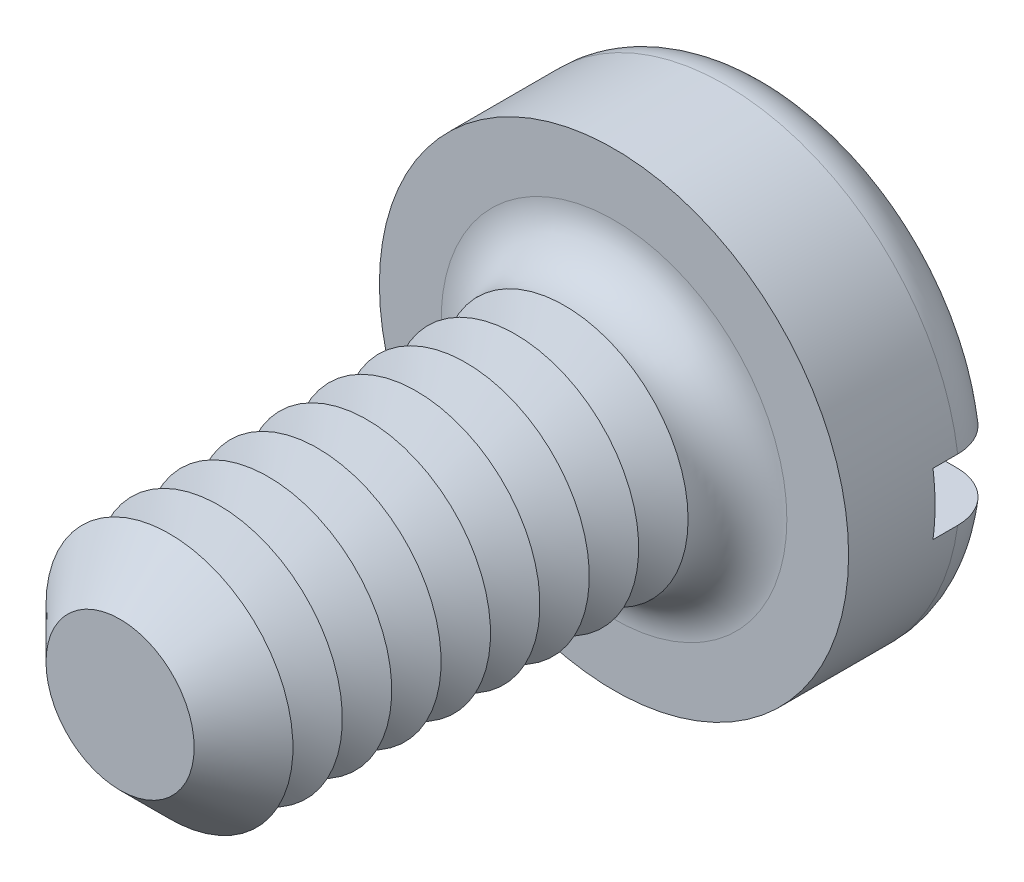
ISO-10303-21;
HEADER;
FILE_DESCRIPTION(('STEP AP214'),'2;1');
FILE_NAME('part.step','',(''),(''),'','','');
FILE_SCHEMA(('AUTOMOTIVE_DESIGN { 1 0 10303 214 1 1 1 1 }'));
ENDSEC;
DATA;
#1=APPLICATION_CONTEXT('core data for automotive mechanical design processes');
#2=APPLICATION_PROTOCOL_DEFINITION('international standard','automotive_design',2000,#1);
#3=PRODUCT_CONTEXT('',#1,'mechanical');
#4=PRODUCT('Part','Part','',(#3));
#5=PRODUCT_RELATED_PRODUCT_CATEGORY('part','',(#4));
#6=PRODUCT_DEFINITION_FORMATION('','',#4);
#7=PRODUCT_DEFINITION_CONTEXT('part definition',#1,'design');
#8=PRODUCT_DEFINITION('design','',#6,#7);
#9=PRODUCT_DEFINITION_SHAPE('','',#8);
#10=(LENGTH_UNIT() NAMED_UNIT(*) SI_UNIT(.MILLI.,.METRE.));
#11=(NAMED_UNIT(*) PLANE_ANGLE_UNIT() SI_UNIT($,.RADIAN.));
#12=(NAMED_UNIT(*) SI_UNIT($,.STERADIAN.) SOLID_ANGLE_UNIT());
#13=UNCERTAINTY_MEASURE_WITH_UNIT(LENGTH_MEASURE(1.E-05),#10,'distance_accuracy_value','');
#14=(GEOMETRIC_REPRESENTATION_CONTEXT(3) GLOBAL_UNCERTAINTY_ASSIGNED_CONTEXT((#13)) GLOBAL_UNIT_ASSIGNED_CONTEXT((#10,
#11,#12)) REPRESENTATION_CONTEXT('',''));
#15=CARTESIAN_POINT('',(0.,0.,0.));
#16=DIRECTION('',(0.,0.,1.));
#17=DIRECTION('',(1.,0.,0.));
#18=AXIS2_PLACEMENT_3D('',#15,#16,#17);
#19=CARTESIAN_POINT('',(0.,0.,-1.3));
#20=DIRECTION('',(0.,0.,1.));
#21=DIRECTION('',(1.,0.,0.));
#22=AXIS2_PLACEMENT_3D('',#19,#20,#21);
#23=PLANE('',#22);
#24=CARTESIAN_POINT('',(0.,0.,-1.3));
#25=DIRECTION('',(0.,0.,1.));
#26=DIRECTION('',(1.,0.,0.));
#27=AXIS2_PLACEMENT_3D('',#24,#25,#26);
#28=CIRCLE('',#27,1.5);
#29=CARTESIAN_POINT('',(-1.4790199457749,0.25,-1.3));
#30=VERTEX_POINT('',#29);
#31=CARTESIAN_POINT('',(1.4790199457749,0.25,-1.3));
#32=VERTEX_POINT('',#31);
#33=EDGE_CURVE('E116',#30,#32,#28,.F.);
#34=ORIENTED_EDGE('',*,*,#33,.T.);
#35=DIRECTION('',(1.,0.,0.));
#36=VECTOR('',#35,1.);
#37=CARTESIAN_POINT('',(-1.9,0.25,-1.3));
#38=LINE('',#37,#36);
#39=EDGE_CURVE('E111',#30,#32,#38,.T.);
#40=ORIENTED_EDGE('',*,*,#39,.F.);
#41=EDGE_LOOP('',(#34,#40));
#42=FACE_BOUND('',#41,.T.);
#43=ADVANCED_FACE('F39',(#42),#23,.F.);
#44=CARTESIAN_POINT('',(0.,0.,-0.9));
#45=DIRECTION('',(0.,0.,1.));
#46=DIRECTION('',(1.,0.,0.));
#47=AXIS2_PLACEMENT_3D('',#44,#45,#46);
#48=TOROIDAL_SURFACE('',#47,1.5,0.4);
#49=CARTESIAN_POINT('',(-1.8150392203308,0.25,-1.12284384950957));
#50=CARTESIAN_POINT('',(-1.80236980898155,0.25,-1.14155059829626));
#51=CARTESIAN_POINT('',(-1.78809920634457,0.25,-1.15919399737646));
#52=CARTESIAN_POINT('',(-1.75677844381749,0.25,-1.19184073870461));
#53=CARTESIAN_POINT('',(-1.73972468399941,0.25,-1.20684060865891));
#54=CARTESIAN_POINT('',(-1.70336024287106,0.25,-1.23375848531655));
#55=CARTESIAN_POINT('',(-1.68405164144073,0.25,-1.24567930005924));
#56=CARTESIAN_POINT('',(-1.64372549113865,0.25,-1.26613528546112));
#57=CARTESIAN_POINT('',(-1.6227083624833,0.25,-1.27467128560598));
#58=CARTESIAN_POINT('',(-1.57937988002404,0.25,-1.2881995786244));
#59=CARTESIAN_POINT('',(-1.55705957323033,0.25,-1.29316318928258));
#60=CARTESIAN_POINT('',(-1.51190394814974,0.25,-1.29931753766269));
#61=CARTESIAN_POINT('',(-1.48906857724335,0.25,-1.3005078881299));
#62=CARTESIAN_POINT('',(-1.4432641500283,0.25,-1.29909058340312));
#63=CARTESIAN_POINT('',(-1.42029638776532,0.25,-1.29644099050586));
#64=CARTESIAN_POINT('',(-1.37512297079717,0.25,-1.28735146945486));
#65=CARTESIAN_POINT('',(-1.3529173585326,0.25,-1.28091133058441));
#66=CARTESIAN_POINT('',(-1.30974098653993,0.25,-1.26436295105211));
#67=CARTESIAN_POINT('',(-1.28877978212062,0.25,-1.25422975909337));
#68=CARTESIAN_POINT('',(-1.24886205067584,0.25,-1.23057736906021));
#69=CARTESIAN_POINT('',(-1.22990554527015,0.25,-1.21705813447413));
#70=CARTESIAN_POINT('',(-1.19461911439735,0.25,-1.18704970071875));
#71=CARTESIAN_POINT('',(-1.17828051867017,0.25,-1.17057070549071));
#72=CARTESIAN_POINT('',(-1.14865897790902,0.25,-1.13506201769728));
#73=CARTESIAN_POINT('',(-1.13537576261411,0.25,-1.11603255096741));
#74=CARTESIAN_POINT('',(-1.11249827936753,0.25,-1.07630328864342));
#75=CARTESIAN_POINT('',(-1.10284494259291,0.25,-1.05563752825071));
#76=CARTESIAN_POINT('',(-1.08724024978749,0.25,-1.01295282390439));
#77=CARTESIAN_POINT('',(-1.08128829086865,0.25,-0.990934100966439));
#78=CARTESIAN_POINT('',(-1.07339124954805,0.25,-0.946722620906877));
#79=CARTESIAN_POINT('',(-1.07135558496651,0.25,-0.924546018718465));
#80=CARTESIAN_POINT('',(-1.07108722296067,0.25,-0.880170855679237));
#81=CARTESIAN_POINT('',(-1.07285419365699,0.25,-0.857972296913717));
#82=CARTESIAN_POINT('',(-1.0800838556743,0.25,-0.814463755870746));
#83=CARTESIAN_POINT('',(-1.08550159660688,0.25,-0.793146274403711));
#84=CARTESIAN_POINT('',(-1.09980522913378,0.25,-0.751709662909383));
#85=CARTESIAN_POINT('',(-1.10869126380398,0.25,-0.731590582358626));
#86=CARTESIAN_POINT('',(-1.12975121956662,0.25,-0.692901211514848));
#87=CARTESIAN_POINT('',(-1.14195627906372,0.25,-0.674347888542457));
#88=CARTESIAN_POINT('',(-1.1692428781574,0.25,-0.639494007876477));
#89=CARTESIAN_POINT('',(-1.18432473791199,0.25,-0.623193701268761));
#90=CARTESIAN_POINT('',(-1.21730350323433,0.25,-0.592916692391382));
#91=CARTESIAN_POINT('',(-1.23525650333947,0.25,-0.579001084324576));
#92=CARTESIAN_POINT('',(-1.27320799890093,0.25,-0.554314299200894));
#93=CARTESIAN_POINT('',(-1.2932067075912,0.25,-0.543543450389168));
#94=CARTESIAN_POINT('',(-1.33509120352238,0.25,-0.525253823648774));
#95=CARTESIAN_POINT('',(-1.35700545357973,0.25,-0.517800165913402));
#96=CARTESIAN_POINT('',(-1.401770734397,0.25,-0.506652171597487));
#97=CARTESIAN_POINT('',(-1.42462180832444,0.25,-0.502958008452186));
#98=CARTESIAN_POINT('',(-1.4707602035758,0.25,-0.499429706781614));
#99=CARTESIAN_POINT('',(-1.49404932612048,0.25,-0.499619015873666));
#100=CARTESIAN_POINT('',(-1.54026206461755,0.25,-0.50392615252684));
#101=CARTESIAN_POINT('',(-1.56318568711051,0.25,-0.508043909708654));
#102=CARTESIAN_POINT('',(-1.60788420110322,0.25,-0.520077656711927));
#103=CARTESIAN_POINT('',(-1.6296645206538,0.25,-0.527973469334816));
#104=CARTESIAN_POINT('',(-1.67156889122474,0.25,-0.547348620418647));
#105=CARTESIAN_POINT('',(-1.69169302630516,0.25,-0.558827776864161));
#106=CARTESIAN_POINT('',(-1.72948251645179,0.25,-0.584913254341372));
#107=CARTESIAN_POINT('',(-1.74717189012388,0.25,-0.599484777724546));
#108=CARTESIAN_POINT('',(-1.77981909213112,0.25,-0.63142070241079));
#109=CARTESIAN_POINT('',(-1.79477707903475,0.25,-0.648784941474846));
#110=CARTESIAN_POINT('',(-1.82136524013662,0.25,-0.685607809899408));
#111=CARTESIAN_POINT('',(-1.83303003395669,0.25,-0.705041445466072));
#112=CARTESIAN_POINT('',(-1.85289960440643,0.25,-0.745602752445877));
#113=CARTESIAN_POINT('',(-1.86110468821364,0.25,-0.76673027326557));
#114=CARTESIAN_POINT('',(-1.87375648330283,0.25,-0.809891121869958));
#115=CARTESIAN_POINT('',(-1.87823381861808,0.25,-0.831915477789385));
#116=CARTESIAN_POINT('',(-1.88341152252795,0.25,-0.87640983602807));
#117=CARTESIAN_POINT('',(-1.88411103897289,0.25,-0.898879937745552));
#118=CARTESIAN_POINT('',(-1.88171559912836,0.25,-0.943534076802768));
#119=CARTESIAN_POINT('',(-1.87863413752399,0.25,-0.965718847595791));
#120=CARTESIAN_POINT('',(-1.86879153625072,0.25,-1.00923650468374));
#121=CARTESIAN_POINT('',(-1.86203494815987,0.25,-1.03057040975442));
#122=CARTESIAN_POINT('',(-1.84837477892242,0.25,-1.06373797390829));
#123=CARTESIAN_POINT('',(-1.84255723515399,0.25,-1.07603047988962));
#124=CARTESIAN_POINT('',(-1.82969924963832,0.25,-1.09995814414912));
#125=CARTESIAN_POINT('',(-1.82265881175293,0.25,-1.11159330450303));
#126=CARTESIAN_POINT('',(-1.8150392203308,0.25,-1.12284384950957));
#127=B_SPLINE_CURVE_WITH_KNOTS('',3,(#49,#50,#51,#52,#53,#54,#55,#56,#57,#58,#59,#60,#61,#62,
#63,#64,#65,#66,#67,#68,#69,#70,#71,#72,#73,#74,#75,#76,#77,#78,#79,#80,#81,#82,#83,#84,#85,#86,
#87,#88,#89,#90,#91,#92,#93,#94,#95,#96,#97,#98,#99,#100,#101,#102,#103,#104,#105,#106,#107,
#108,#109,#110,#111,#112,#113,#114,#115,#116,#117,#118,#119,#120,#121,#122,#123,#124,#125,#126),
.UNSPECIFIED.,.T.,.F.,(4,2,2,2,2,2,2,2,2,2,2,2,2,2,2,2,2,2,2,2,2,2,2,2,2,2,2,2,2,2,2,2,2,2,2,2,
2,2,4),(0.,0.0677296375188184,0.135547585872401,0.203303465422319,0.27104273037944,
0.339319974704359,0.407604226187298,0.47663988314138,0.545679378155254,0.615194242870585,
0.684709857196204,0.753990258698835,0.82326452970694,0.891356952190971,0.959438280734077,
1.02592503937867,1.0924059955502,1.15808300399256,1.2237627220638,1.29008126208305,
1.35640718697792,1.4242376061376,1.49207510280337,1.5611911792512,1.63031044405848,
1.69984715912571,1.76938262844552,1.8385508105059,1.90771547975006,1.97613962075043,
2.04455978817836,2.11223135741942,2.17989691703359,2.24700094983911,2.31412011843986,
2.38100042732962,2.44779809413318,2.48853193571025,2.52926564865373),.UNSPECIFIED.);
#128=CARTESIAN_POINT('',(-1.88348082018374,0.25,-0.9));
#129=VERTEX_POINT('',#128);
#130=EDGE_CURVE('E241',#129,#30,#127,.T.);
#131=ORIENTED_EDGE('',*,*,#130,.F.);
#132=CARTESIAN_POINT('',(0.,0.,-0.9));
#133=DIRECTION('',(0.,0.,1.));
#134=DIRECTION('',(1.,0.,0.));
#135=AXIS2_PLACEMENT_3D('',#132,#133,#134);
#136=CIRCLE('',#135,1.9);
#137=CARTESIAN_POINT('',(1.88348082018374,0.25,-0.9));
#138=VERTEX_POINT('',#137);
#139=EDGE_CURVE('E123',#138,#129,#136,.T.);
#140=ORIENTED_EDGE('',*,*,#139,.F.);
#141=CARTESIAN_POINT('',(1.11362660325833,0.25,-1.07710243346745));
#142=CARTESIAN_POINT('',(1.12388366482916,0.25,-1.09736755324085));
#143=CARTESIAN_POINT('',(1.13589127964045,0.25,-1.11676768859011));
#144=CARTESIAN_POINT('',(1.16301945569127,0.25,-1.15328107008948));
#145=CARTESIAN_POINT('',(1.17814463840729,0.25,-1.17039085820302));
#146=CARTESIAN_POINT('',(1.21101661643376,0.25,-1.20182395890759));
#147=CARTESIAN_POINT('',(1.22875976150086,0.25,-1.21615108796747));
#148=CARTESIAN_POINT('',(1.26636392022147,0.25,-1.24166932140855));
#149=CARTESIAN_POINT('',(1.28622436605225,0.25,-1.25286126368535));
#150=CARTESIAN_POINT('',(1.32781377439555,0.25,-1.27196191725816));
#151=CARTESIAN_POINT('',(1.34956550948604,0.25,-1.27982107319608));
#152=CARTESIAN_POINT('',(1.39407620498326,0.25,-1.29180513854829));
#153=CARTESIAN_POINT('',(1.41683526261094,0.25,-1.29592968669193));
#154=CARTESIAN_POINT('',(1.46288034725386,0.25,-1.3003367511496));
#155=CARTESIAN_POINT('',(1.48616890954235,0.25,-1.30059287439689));
#156=CARTESIAN_POINT('',(1.53245605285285,0.25,-1.29717239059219));
#157=CARTESIAN_POINT('',(1.55545463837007,0.25,-1.29349584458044));
#158=CARTESIAN_POINT('',(1.60038828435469,0.25,-1.28232271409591));
#159=CARTESIAN_POINT('',(1.62232790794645,0.25,-1.27484449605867));
#160=CARTESIAN_POINT('',(1.66461970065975,0.25,-1.25627203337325));
#161=CARTESIAN_POINT('',(1.68497195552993,0.25,-1.24517798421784));
#162=CARTESIAN_POINT('',(1.72328060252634,0.25,-1.21981269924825));
#163=CARTESIAN_POINT('',(1.74126001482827,0.25,-1.2055762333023));
#164=CARTESIAN_POINT('',(1.77453973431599,0.25,-1.17425606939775));
#165=CARTESIAN_POINT('',(1.78984019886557,0.25,-1.1571725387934));
#166=CARTESIAN_POINT('',(1.81715014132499,0.25,-1.12084732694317));
#167=CARTESIAN_POINT('',(1.82919410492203,0.25,-1.10163156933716));
#168=CARTESIAN_POINT('',(1.84985315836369,0.25,-1.06143759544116));
#169=CARTESIAN_POINT('',(1.85846842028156,0.25,-1.04045946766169));
#170=CARTESIAN_POINT('',(1.87195437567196,0.25,-0.997526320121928));
#171=CARTESIAN_POINT('',(1.87685590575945,0.25,-0.975580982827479));
#172=CARTESIAN_POINT('',(1.88288741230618,0.25,-0.931178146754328));
#173=CARTESIAN_POINT('',(1.88401750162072,0.25,-0.908720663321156));
#174=CARTESIAN_POINT('',(1.88247598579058,0.25,-0.864033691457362));
#175=CARTESIAN_POINT('',(1.87982069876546,0.25,-0.841803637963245));
#176=CARTESIAN_POINT('',(1.87081646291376,0.25,-0.798104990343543));
#177=CARTESIAN_POINT('',(1.86446754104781,0.25,-0.776636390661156));
#178=CARTESIAN_POINT('',(1.84826063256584,0.25,-0.735060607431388));
#179=CARTESIAN_POINT('',(1.83840161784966,0.25,-0.714953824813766));
#180=CARTESIAN_POINT('',(1.81546327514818,0.25,-0.676670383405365));
#181=CARTESIAN_POINT('',(1.80238389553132,0.25,-0.658493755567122));
#182=CARTESIAN_POINT('',(1.77331327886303,0.25,-0.62448916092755));
#183=CARTESIAN_POINT('',(1.75730833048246,0.25,-0.608672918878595));
#184=CARTESIAN_POINT('',(1.72289038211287,0.25,-0.579924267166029));
#185=CARTESIAN_POINT('',(1.70447729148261,0.25,-0.566991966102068));
#186=CARTESIAN_POINT('',(1.66559643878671,0.25,-0.544254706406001));
#187=CARTESIAN_POINT('',(1.64511218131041,0.25,-0.53447796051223));
#188=CARTESIAN_POINT('',(1.60280554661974,0.25,-0.518459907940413));
#189=CARTESIAN_POINT('',(1.58098309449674,0.25,-0.512218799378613));
#190=CARTESIAN_POINT('',(1.53636184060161,0.25,-0.503375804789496));
#191=CARTESIAN_POINT('',(1.51355490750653,0.25,-0.500814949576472));
#192=CARTESIAN_POINT('',(1.46783245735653,0.25,-0.499516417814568));
#193=CARTESIAN_POINT('',(1.44491693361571,0.25,-0.500778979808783));
#194=CARTESIAN_POINT('',(1.39937748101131,0.25,-0.50711284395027));
#195=CARTESIAN_POINT('',(1.37675897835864,0.25,-0.512223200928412));
#196=CARTESIAN_POINT('',(1.33269286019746,0.25,-0.526151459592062));
#197=CARTESIAN_POINT('',(1.31124530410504,0.25,-0.534969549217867));
#198=CARTESIAN_POINT('',(1.27004097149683,0.25,-0.556118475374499));
#199=CARTESIAN_POINT('',(1.25029179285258,0.25,-0.568464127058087));
#200=CARTESIAN_POINT('',(1.21316554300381,0.25,-0.59631968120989));
#201=CARTESIAN_POINT('',(1.19578844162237,0.25,-0.611829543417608));
#202=CARTESIAN_POINT('',(1.16406059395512,0.25,-0.645459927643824));
#203=CARTESIAN_POINT('',(1.14968747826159,0.25,-0.663559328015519));
#204=CARTESIAN_POINT('',(1.12425968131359,0.25,-0.70195566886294));
#205=CARTESIAN_POINT('',(1.11320445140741,0.25,-0.722252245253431));
#206=CARTESIAN_POINT('',(1.09497726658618,0.25,-0.764020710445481));
#207=CARTESIAN_POINT('',(1.08772970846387,0.25,-0.785459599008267));
#208=CARTESIAN_POINT('',(1.07702618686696,0.25,-0.829269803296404));
#209=CARTESIAN_POINT('',(1.07357062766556,0.25,-0.851641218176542));
#210=CARTESIAN_POINT('',(1.07060826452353,0.25,-0.896160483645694));
#211=CARTESIAN_POINT('',(1.07101876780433,0.25,-0.918302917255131));
#212=CARTESIAN_POINT('',(1.07557730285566,0.25,-0.962179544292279));
#213=CARTESIAN_POINT('',(1.07972048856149,0.25,-0.983914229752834));
#214=CARTESIAN_POINT('',(1.08912066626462,0.25,-1.01754924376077));
#215=CARTESIAN_POINT('',(1.09320341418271,0.25,-1.02979035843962));
#216=CARTESIAN_POINT('',(1.10254493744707,0.25,-1.05381470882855));
#217=CARTESIAN_POINT('',(1.10780368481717,0.25,-1.06559795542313));
#218=CARTESIAN_POINT('',(1.11362660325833,0.25,-1.07710243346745));
#219=B_SPLINE_CURVE_WITH_KNOTS('',3,(#141,#142,#143,#144,#145,#146,#147,#148,#149,#150,#151,
#152,#153,#154,#155,#156,#157,#158,#159,#160,#161,#162,#163,#164,#165,#166,#167,#168,#169,#170,
#171,#172,#173,#174,#175,#176,#177,#178,#179,#180,#181,#182,#183,#184,#185,#186,#187,#188,#189,
#190,#191,#192,#193,#194,#195,#196,#197,#198,#199,#200,#201,#202,#203,#204,#205,#206,#207,#208,
#209,#210,#211,#212,#213,#214,#215,#216,#217,#218),.UNSPECIFIED.,.T.,.F.,(4,2,2,2,2,2,2,2,2,2,2,
2,2,2,2,2,2,2,2,2,2,2,2,2,2,2,2,2,2,2,2,2,2,2,2,2,2,2,4),(0.,0.0680907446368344,
0.136283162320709,0.204381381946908,0.272461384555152,0.341520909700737,0.410587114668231,
0.480124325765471,0.549660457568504,0.618863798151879,0.688063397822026,0.756532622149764,
0.824997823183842,0.892706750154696,0.960412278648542,1.02754926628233,1.09468424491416,
1.16153068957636,1.22837664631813,1.29524219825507,1.36210882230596,1.42929726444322,
1.49648823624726,1.56426429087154,1.63204414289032,1.70057395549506,1.76910804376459,
1.83834728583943,1.90759003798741,1.97712798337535,2.0466650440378,2.11566422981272,
2.18465199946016,2.25221259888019,2.3197804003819,2.38590630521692,2.45194648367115,
2.49060241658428,2.5292574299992),.UNSPECIFIED.);
#220=EDGE_CURVE('E243',#32,#138,#219,.T.);
#221=ORIENTED_EDGE('',*,*,#220,.F.);
#222=ORIENTED_EDGE('',*,*,#33,.F.);
#223=EDGE_LOOP('',(#131,#140,#221,#222));
#224=FACE_BOUND('',#223,.T.);
#225=ADVANCED_FACE('F225',(#224),#48,.T.);
#226=CARTESIAN_POINT('',(0.,0.,-1.3));
#227=DIRECTION('',(0.,0.,1.));
#228=DIRECTION('',(1.,0.,0.));
#229=AXIS2_PLACEMENT_3D('',#226,#227,#228);
#230=CYLINDRICAL_SURFACE('',#229,1.9);
#231=DIRECTION('',(0.,0.,1.));
#232=VECTOR('',#231,1.);
#233=CARTESIAN_POINT('',(1.88348082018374,0.25,-1.3));
#234=LINE('',#233,#232);
#235=CARTESIAN_POINT('',(1.88348082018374,0.25,-0.7));
#236=VERTEX_POINT('',#235);
#237=EDGE_CURVE('E258',#138,#236,#234,.T.);
#238=ORIENTED_EDGE('',*,*,#237,.F.);
#239=ORIENTED_EDGE('',*,*,#139,.T.);
#240=DIRECTION('',(0.,0.,1.));
#241=VECTOR('',#240,1.);
#242=CARTESIAN_POINT('',(-1.88348082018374,0.25,-1.3));
#243=LINE('',#242,#241);
#244=CARTESIAN_POINT('',(-1.88348082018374,0.25,-0.7));
#245=VERTEX_POINT('',#244);
#246=EDGE_CURVE('E63',#245,#129,#243,.F.);
#247=ORIENTED_EDGE('',*,*,#246,.F.);
#248=CARTESIAN_POINT('',(0.,0.,-0.7));
#249=DIRECTION('',(0.,0.,-1.));
#250=DIRECTION('',(-1.,0.,0.));
#251=AXIS2_PLACEMENT_3D('',#248,#249,#250);
#252=CIRCLE('',#251,1.9);
#253=CARTESIAN_POINT('',(-1.88348082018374,-0.25,-0.7));
#254=VERTEX_POINT('',#253);
#255=EDGE_CURVE('E43',#245,#254,#252,.F.);
#256=ORIENTED_EDGE('',*,*,#255,.T.);
#257=DIRECTION('',(0.,0.,1.));
#258=VECTOR('',#257,1.);
#259=CARTESIAN_POINT('',(-1.88348082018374,-0.25,-1.3));
#260=LINE('',#259,#258);
#261=CARTESIAN_POINT('',(-1.88348082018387,-0.25,-0.899999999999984));
#262=VERTEX_POINT('',#261);
#263=EDGE_CURVE('E255',#262,#254,#260,.T.);
#264=ORIENTED_EDGE('',*,*,#263,.F.);
#265=CARTESIAN_POINT('',(1.88348082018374,-0.25,-0.9));
#266=VERTEX_POINT('',#265);
#267=EDGE_CURVE('E125',#262,#266,#136,.T.);
#268=ORIENTED_EDGE('',*,*,#267,.T.);
#269=DIRECTION('',(0.,0.,1.));
#270=VECTOR('',#269,1.);
#271=CARTESIAN_POINT('',(1.88348082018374,-0.25,-1.3));
#272=LINE('',#271,#270);
#273=CARTESIAN_POINT('',(1.88348082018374,-0.25,-0.7));
#274=VERTEX_POINT('',#273);
#275=EDGE_CURVE('E55',#274,#266,#272,.F.);
#276=ORIENTED_EDGE('',*,*,#275,.F.);
#277=EDGE_CURVE('E11',#274,#236,#252,.F.);
#278=ORIENTED_EDGE('',*,*,#277,.T.);
#279=EDGE_LOOP('',(#238,#239,#247,#256,#264,#268,#276,#278));
#280=FACE_BOUND('',#279,.T.);
#281=CARTESIAN_POINT('',(0.,0.,0.));
#282=DIRECTION('',(0.,0.,1.));
#283=DIRECTION('',(1.,0.,0.));
#284=AXIS2_PLACEMENT_3D('',#281,#282,#283);
#285=CIRCLE('',#284,1.9);
#286=CARTESIAN_POINT('',(1.9,0.,0.));
#287=VERTEX_POINT('',#286);
#288=EDGE_CURVE('E261',#287,#287,#285,.T.);
#289=ORIENTED_EDGE('',*,*,#288,.F.);
#290=EDGE_LOOP('',(#289));
#291=FACE_BOUND('',#290,.T.);
#292=ADVANCED_FACE('F221',(#280,#291),#230,.T.);
#293=CARTESIAN_POINT('',(1.4790199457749,-0.25,-1.3));
#294=VERTEX_POINT('',#293);
#295=CARTESIAN_POINT('',(-1.4790199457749,-0.25,-1.3));
#296=VERTEX_POINT('',#295);
#297=EDGE_CURVE('E109',#294,#296,#28,.F.);
#298=ORIENTED_EDGE('',*,*,#297,.T.);
#299=DIRECTION('',(-1.,0.,0.));
#300=VECTOR('',#299,1.);
#301=CARTESIAN_POINT('',(-1.9,-0.25,-1.3));
#302=LINE('',#301,#300);
#303=EDGE_CURVE('E96',#294,#296,#302,.T.);
#304=ORIENTED_EDGE('',*,*,#303,.F.);
#305=EDGE_LOOP('',(#298,#304));
#306=FACE_BOUND('',#305,.T.);
#307=ADVANCED_FACE('F108',(#306),#23,.F.);
#308=CARTESIAN_POINT('',(0.,0.,0.));
#309=DIRECTION('',(0.,0.,1.));
#310=DIRECTION('',(1.,0.,0.));
#311=AXIS2_PLACEMENT_3D('',#308,#309,#310);
#312=PLANE('',#311);
#313=CARTESIAN_POINT('',(0.,0.,0.));
#314=DIRECTION('',(0.,0.,1.));
#315=DIRECTION('',(1.,0.,0.));
#316=AXIS2_PLACEMENT_3D('',#313,#314,#315);
#317=CIRCLE('',#316,1.4);
#318=CARTESIAN_POINT('',(1.4,0.,0.));
#319=VERTEX_POINT('',#318);
#320=EDGE_CURVE('E115',#319,#319,#317,.F.);
#321=ORIENTED_EDGE('',*,*,#320,.T.);
#322=EDGE_LOOP('',(#321));
#323=FACE_BOUND('',#322,.T.);
#324=ORIENTED_EDGE('',*,*,#288,.T.);
#325=EDGE_LOOP('',(#324));
#326=FACE_BOUND('',#325,.T.);
#327=ADVANCED_FACE('F220',(#323,#326),#312,.T.);
#328=CARTESIAN_POINT('',(-1.8150392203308,-0.25,-1.12284384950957));
#329=CARTESIAN_POINT('',(-1.82756185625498,-0.25,-1.10435021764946));
#330=CARTESIAN_POINT('',(-1.83853807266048,-0.25,-1.08479072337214));
#331=CARTESIAN_POINT('',(-1.85706233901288,-0.25,-1.04409188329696));
#332=CARTESIAN_POINT('',(-1.86460655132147,-0.25,-1.02295079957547));
#333=CARTESIAN_POINT('',(-1.87603074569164,-0.25,-0.979704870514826));
#334=CARTESIAN_POINT('',(-1.87991177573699,-0.25,-0.957600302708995));
#335=CARTESIAN_POINT('',(-1.88389586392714,-0.25,-0.913058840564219));
#336=CARTESIAN_POINT('',(-1.88399981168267,-0.25,-0.890622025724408));
#337=CARTESIAN_POINT('',(-1.88043374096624,-0.25,-0.846104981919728));
#338=CARTESIAN_POINT('',(-1.87677281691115,-0.25,-0.824024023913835));
#339=CARTESIAN_POINT('',(-1.86579880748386,-0.25,-0.780788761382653));
#340=CARTESIAN_POINT('',(-1.85848560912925,-0.25,-0.759634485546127));
#341=CARTESIAN_POINT('',(-1.8404137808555,-0.25,-0.718830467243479));
#342=CARTESIAN_POINT('',(-1.82965205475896,-0.25,-0.699182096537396));
#343=CARTESIAN_POINT('',(-1.80499939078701,-0.25,-0.661958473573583));
#344=CARTESIAN_POINT('',(-1.7911083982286,-0.25,-0.644383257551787));
#345=CARTESIAN_POINT('',(-1.76051564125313,-0.25,-0.611699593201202));
#346=CARTESIAN_POINT('',(-1.74379913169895,-0.25,-0.596604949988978));
#347=CARTESIAN_POINT('',(-1.70808901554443,-0.25,-0.569406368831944));
#348=CARTESIAN_POINT('',(-1.68909532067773,-0.25,-0.557302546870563));
#349=CARTESIAN_POINT('',(-1.64918615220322,-0.25,-0.536307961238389));
#350=CARTESIAN_POINT('',(-1.62825469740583,-0.25,-0.527447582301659));
#351=CARTESIAN_POINT('',(-1.58521203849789,-0.25,-0.513323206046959));
#352=CARTESIAN_POINT('',(-1.5631007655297,-0.25,-0.508059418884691));
#353=CARTESIAN_POINT('',(-1.51806209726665,-0.25,-0.501215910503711));
#354=CARTESIAN_POINT('',(-1.4951283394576,-0.25,-0.499678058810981));
#355=CARTESIAN_POINT('',(-1.4493239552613,-0.25,-0.500434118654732));
#356=CARTESIAN_POINT('',(-1.4264533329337,-0.25,-0.502728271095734));
#357=CARTESIAN_POINT('',(-1.38118643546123,-0.25,-0.511115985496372));
#358=CARTESIAN_POINT('',(-1.35879703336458,-0.25,-0.51724667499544));
#359=CARTESIAN_POINT('',(-1.31535851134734,-0.25,-0.533167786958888));
#360=CARTESIAN_POINT('',(-1.29430945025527,-0.25,-0.542958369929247));
#361=CARTESIAN_POINT('',(-1.25409242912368,-0.25,-0.565968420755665));
#362=CARTESIAN_POINT('',(-1.23493023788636,-0.25,-0.579197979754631));
#363=CARTESIAN_POINT('',(-1.19912477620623,-0.25,-0.608715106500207));
#364=CARTESIAN_POINT('',(-1.18248143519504,-0.25,-0.625002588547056));
#365=CARTESIAN_POINT('',(-1.15237533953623,-0.25,-0.660018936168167));
#366=CARTESIAN_POINT('',(-1.13888343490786,-0.25,-0.678722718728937));
#367=CARTESIAN_POINT('',(-1.115312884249,-0.25,-0.718170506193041));
#368=CARTESIAN_POINT('',(-1.10523377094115,-0.25,-0.738914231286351));
#369=CARTESIAN_POINT('',(-1.08901310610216,-0.25,-0.781372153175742));
#370=CARTESIAN_POINT('',(-1.08279080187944,-0.25,-0.803055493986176));
#371=CARTESIAN_POINT('',(-1.07416105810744,-0.25,-0.847167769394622));
#372=CARTESIAN_POINT('',(-1.07175306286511,-0.25,-0.869596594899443));
#373=CARTESIAN_POINT('',(-1.07084656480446,-0.25,-0.914070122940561));
#374=CARTESIAN_POINT('',(-1.07226874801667,-0.25,-0.936113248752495));
#375=CARTESIAN_POINT('',(-1.07880428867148,-0.25,-0.979644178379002));
#376=CARTESIAN_POINT('',(-1.08391755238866,-0.25,-1.00113199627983));
#377=CARTESIAN_POINT('',(-1.09764616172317,-0.25,-1.04290115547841));
#378=CARTESIAN_POINT('',(-1.10625346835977,-0.25,-1.06318514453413));
#379=CARTESIAN_POINT('',(-1.12669365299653,-0.25,-1.10205584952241));
#380=CARTESIAN_POINT('',(-1.13852679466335,-0.25,-1.12064242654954));
#381=CARTESIAN_POINT('',(-1.16529672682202,-0.25,-1.15594801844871));
#382=CARTESIAN_POINT('',(-1.18028464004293,-0.25,-1.17262825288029));
#383=CARTESIAN_POINT('',(-1.21279183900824,-0.25,-1.20330600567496));
#384=CARTESIAN_POINT('',(-1.23031142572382,-0.25,-1.21730320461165));
#385=CARTESIAN_POINT('',(-1.26781695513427,-0.25,-1.24254670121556));
#386=CARTESIAN_POINT('',(-1.28784999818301,-0.25,-1.25372305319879));
#387=CARTESIAN_POINT('',(-1.3294899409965,-0.25,-1.27260611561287));
#388=CARTESIAN_POINT('',(-1.35109697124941,-0.25,-1.28031253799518));
#389=CARTESIAN_POINT('',(-1.39558575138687,-0.25,-1.29212626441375));
#390=CARTESIAN_POINT('',(-1.4184807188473,-0.25,-1.29618386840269));
#391=CARTESIAN_POINT('',(-1.4646266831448,-0.25,-1.30039947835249));
#392=CARTESIAN_POINT('',(-1.48787767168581,-0.25,-1.30055757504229));
#393=CARTESIAN_POINT('',(-1.53407883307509,-0.25,-1.29695468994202));
#394=CARTESIAN_POINT('',(-1.55702895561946,-0.25,-1.29319306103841));
#395=CARTESIAN_POINT('',(-1.60196718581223,-0.25,-1.28183520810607));
#396=CARTESIAN_POINT('',(-1.62395508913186,-0.25,-1.27423817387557));
#397=CARTESIAN_POINT('',(-1.66614393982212,-0.25,-1.25548646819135));
#398=CARTESIAN_POINT('',(-1.68635782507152,-0.25,-1.24436087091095));
#399=CARTESIAN_POINT('',(-1.72458266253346,-0.25,-1.21884344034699));
#400=CARTESIAN_POINT('',(-1.74259637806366,-0.25,-1.20445577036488));
#401=CARTESIAN_POINT('',(-1.76968989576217,-0.25,-1.1787247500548));
#402=CARTESIAN_POINT('',(-1.77959984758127,-0.25,-1.1682407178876));
#403=CARTESIAN_POINT('',(-1.79823423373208,-0.25,-1.14626700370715));
#404=CARTESIAN_POINT('',(-1.80695867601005,-0.25,-1.1347773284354));
#405=CARTESIAN_POINT('',(-1.8150392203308,-0.25,-1.12284384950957));
#406=B_SPLINE_CURVE_WITH_KNOTS('',3,(#328,#329,#330,#331,#332,#333,#334,#335,#336,#337,#338,
#339,#340,#341,#342,#343,#344,#345,#346,#347,#348,#349,#350,#351,#352,#353,#354,#355,#356,#357,
#358,#359,#360,#361,#362,#363,#364,#365,#366,#367,#368,#369,#370,#371,#372,#373,#374,#375,#376,
#377,#378,#379,#380,#381,#382,#383,#384,#385,#386,#387,#388,#389,#390,#391,#392,#393,#394,#395,
#396,#397,#398,#399,#400,#401,#402,#403,#404,#405),.UNSPECIFIED.,.T.,.F.,(4,2,2,2,2,2,2,2,2,2,2,
2,2,2,2,2,2,2,2,2,2,2,2,2,2,2,2,2,2,2,2,2,2,2,2,2,2,2,4),(0.,0.0669512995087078,
0.133977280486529,0.200984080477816,0.267975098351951,0.334804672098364,0.401636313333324,
0.468528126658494,0.535421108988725,0.602674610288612,0.669930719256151,0.737801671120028,
0.805676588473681,0.87431077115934,0.942949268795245,1.0122625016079,1.08157877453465,
1.15110078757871,1.22062085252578,1.28946987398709,1.35830946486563,1.42565417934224,
1.49298908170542,1.55894041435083,1.62489007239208,1.69068884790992,1.75649300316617,
1.82345932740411,1.89043361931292,1.95893391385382,2.02743989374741,2.09686543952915,
2.16628937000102,2.23572476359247,2.3051748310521,2.3740669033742,2.44287154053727,
2.48607383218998,2.52927583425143),.UNSPECIFIED.);
#407=EDGE_CURVE('E103',#296,#262,#406,.T.);
#408=ORIENTED_EDGE('',*,*,#407,.F.);
#409=ORIENTED_EDGE('',*,*,#297,.F.);
#410=CARTESIAN_POINT('',(1.11362660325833,-0.25,-1.07710243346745));
#411=CARTESIAN_POINT('',(1.10368387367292,-0.25,-1.05745397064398));
#412=CARTESIAN_POINT('',(1.09537204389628,-0.25,-1.0369644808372));
#413=CARTESIAN_POINT('',(1.08229212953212,-0.25,-0.994867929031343));
#414=CARTESIAN_POINT('',(1.07752732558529,-0.25,-0.973259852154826));
#415=CARTESIAN_POINT('',(1.07171197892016,-0.25,-0.929545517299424));
#416=CARTESIAN_POINT('',(1.07066166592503,-0.25,-0.907439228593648));
#417=CARTESIAN_POINT('',(1.07231382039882,-0.25,-0.863372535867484));
#418=CARTESIAN_POINT('',(1.07501551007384,-0.25,-0.841412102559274));
#419=CARTESIAN_POINT('',(1.08404966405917,-0.25,-0.798386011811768));
#420=CARTESIAN_POINT('',(1.09036099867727,-0.25,-0.777315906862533));
#421=CARTESIAN_POINT('',(1.10638973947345,-0.25,-0.736514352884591));
#422=CARTESIAN_POINT('',(1.11610743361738,-0.25,-0.716783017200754));
#423=CARTESIAN_POINT('',(1.13878208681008,-0.25,-0.678952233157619));
#424=CARTESIAN_POINT('',(1.15177705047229,-0.25,-0.660875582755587));
#425=CARTESIAN_POINT('',(1.18055347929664,-0.25,-0.62709692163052));
#426=CARTESIAN_POINT('',(1.19633525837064,-0.25,-0.611395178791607));
#427=CARTESIAN_POINT('',(1.23062926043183,-0.25,-0.582430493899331));
#428=CARTESIAN_POINT('',(1.24919608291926,-0.25,-0.569232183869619));
#429=CARTESIAN_POINT('',(1.28825118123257,-0.25,-0.546076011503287));
#430=CARTESIAN_POINT('',(1.30873964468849,-0.25,-0.536118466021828));
#431=CARTESIAN_POINT('',(1.35144534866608,-0.25,-0.519560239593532));
#432=CARTESIAN_POINT('',(1.3736865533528,-0.25,-0.513021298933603));
#433=CARTESIAN_POINT('',(1.41894945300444,-0.25,-0.503751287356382));
#434=CARTESIAN_POINT('',(1.44197117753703,-0.25,-0.50102036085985));
#435=CARTESIAN_POINT('',(1.48824913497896,-0.25,-0.499449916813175));
#436=CARTESIAN_POINT('',(1.5115059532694,-0.25,-0.500627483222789));
#437=CARTESIAN_POINT('',(1.55748678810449,-0.25,-0.506895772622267));
#438=CARTESIAN_POINT('',(1.58021081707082,-0.25,-0.511986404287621));
#439=CARTESIAN_POINT('',(1.6243247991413,-0.25,-0.525910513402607));
#440=CARTESIAN_POINT('',(1.64572225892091,-0.25,-0.534720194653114));
#441=CARTESIAN_POINT('',(1.68671060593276,-0.25,-0.555845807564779));
#442=CARTESIAN_POINT('',(1.70630159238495,-0.25,-0.568161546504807));
#443=CARTESIAN_POINT('',(1.74289060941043,-0.25,-0.595805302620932));
#444=CARTESIAN_POINT('',(1.75991474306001,-0.25,-0.611098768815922));
#445=CARTESIAN_POINT('',(1.79111916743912,-0.25,-0.644354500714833));
#446=CARTESIAN_POINT('',(1.80529962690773,-0.25,-0.662316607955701));
#447=CARTESIAN_POINT('',(1.83025525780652,-0.25,-0.700191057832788));
#448=CARTESIAN_POINT('',(1.84106535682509,-0.25,-0.720080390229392));
#449=CARTESIAN_POINT('',(1.8591630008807,-0.25,-0.761401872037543));
#450=CARTESIAN_POINT('',(1.86645070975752,-0.25,-0.782833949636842));
#451=CARTESIAN_POINT('',(1.87724305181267,-0.25,-0.826454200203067));
#452=CARTESIAN_POINT('',(1.88077646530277,-0.25,-0.848635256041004));
#453=CARTESIAN_POINT('',(1.88405487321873,-0.25,-0.89327539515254));
#454=CARTESIAN_POINT('',(1.88379996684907,-0.25,-0.915734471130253));
#455=CARTESIAN_POINT('',(1.87951702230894,-0.25,-0.96021054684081));
#456=CARTESIAN_POINT('',(1.87550211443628,-0.25,-0.982228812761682));
#457=CARTESIAN_POINT('',(1.86383665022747,-0.25,-1.0252797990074));
#458=CARTESIAN_POINT('',(1.85618610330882,-0.25,-1.04631252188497));
#459=CARTESIAN_POINT('',(1.83746332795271,-0.25,-1.08682395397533));
#460=CARTESIAN_POINT('',(1.82638722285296,-0.25,-1.10630087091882));
#461=CARTESIAN_POINT('',(1.80113946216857,-0.25,-1.14313202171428));
#462=CARTESIAN_POINT('',(1.78696774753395,-0.25,-1.1604862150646));
#463=CARTESIAN_POINT('',(1.75585044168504,-0.25,-1.19268694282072));
#464=CARTESIAN_POINT('',(1.73888979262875,-0.25,-1.20751892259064));
#465=CARTESIAN_POINT('',(1.7027387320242,-0.25,-1.23415579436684));
#466=CARTESIAN_POINT('',(1.68354822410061,-0.25,-1.24596055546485));
#467=CARTESIAN_POINT('',(1.64329341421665,-0.25,-1.26632784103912));
#468=CARTESIAN_POINT('',(1.62221336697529,-0.25,-1.27485924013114));
#469=CARTESIAN_POINT('',(1.5789301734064,-0.25,-1.28830571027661));
#470=CARTESIAN_POINT('',(1.55672695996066,-0.25,-1.29322056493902));
#471=CARTESIAN_POINT('',(1.5115614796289,-0.25,-1.29935191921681));
#472=CARTESIAN_POINT('',(1.4885934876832,-0.25,-1.30052625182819));
#473=CARTESIAN_POINT('',(1.44278240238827,-0.25,-1.2990417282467));
#474=CARTESIAN_POINT('',(1.41993931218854,-0.25,-1.29638277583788));
#475=CARTESIAN_POINT('',(1.37479511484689,-0.25,-1.28727159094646));
#476=CARTESIAN_POINT('',(1.35250125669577,-0.25,-1.2807834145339));
#477=CARTESIAN_POINT('',(1.30930729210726,-0.25,-1.2641644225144));
#478=CARTESIAN_POINT('',(1.2884075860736,-0.25,-1.25403256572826));
#479=CARTESIAN_POINT('',(1.24854853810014,-0.25,-1.23036781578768));
#480=CARTESIAN_POINT('',(1.22959511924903,-0.25,-1.21682495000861));
#481=CARTESIAN_POINT('',(1.19427766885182,-0.25,-1.18672803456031));
#482=CARTESIAN_POINT('',(1.17791048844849,-0.25,-1.170177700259));
#483=CARTESIAN_POINT('',(1.15346856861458,-0.25,-1.14079355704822));
#484=CARTESIAN_POINT('',(1.14449891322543,-0.25,-1.12869247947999));
#485=CARTESIAN_POINT('',(1.12797460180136,-0.25,-1.10355927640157));
#486=CARTESIAN_POINT('',(1.1204199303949,-0.25,-1.09052716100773));
#487=CARTESIAN_POINT('',(1.11362660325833,-0.25,-1.07710243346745));
#488=B_SPLINE_CURVE_WITH_KNOTS('',3,(#410,#411,#412,#413,#414,#415,#416,#417,#418,#419,#420,
#421,#422,#423,#424,#425,#426,#427,#428,#429,#430,#431,#432,#433,#434,#435,#436,#437,#438,#439,
#440,#441,#442,#443,#444,#445,#446,#447,#448,#449,#450,#451,#452,#453,#454,#455,#456,#457,#458,
#459,#460,#461,#462,#463,#464,#465,#466,#467,#468,#469,#470,#471,#472,#473,#474,#475,#476,#477,
#478,#479,#480,#481,#482,#483,#484,#485,#486,#487),.UNSPECIFIED.,.T.,.F.,(4,2,2,2,2,2,2,2,2,2,2,
2,2,2,2,2,2,2,2,2,2,2,2,2,2,2,2,2,2,2,2,2,2,2,2,2,2,2,4),(0.,0.0660089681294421,
0.132078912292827,0.198152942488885,0.26421327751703,0.329890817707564,0.395573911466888,
0.462056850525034,0.528547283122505,0.596571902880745,0.664603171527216,0.733823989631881,
0.803047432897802,0.872573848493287,0.94209864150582,1.01118516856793,1.08026789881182,
1.14859228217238,1.21691261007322,1.28449938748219,1.35208302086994,1.41914473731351,
1.48620469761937,1.55303134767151,1.61985782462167,1.68676020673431,1.75366386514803,
1.82094137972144,1.88822180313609,1.95612699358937,2.0240362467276,2.09270838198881,
2.16138224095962,2.23071121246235,2.30006001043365,2.36961396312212,2.4390825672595,
2.48418340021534,2.52928374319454),.UNSPECIFIED.);
#489=EDGE_CURVE('E92',#266,#294,#488,.T.);
#490=ORIENTED_EDGE('',*,*,#489,.F.);
#491=ORIENTED_EDGE('',*,*,#267,.F.);
#492=EDGE_LOOP('',(#408,#409,#490,#491));
#493=FACE_BOUND('',#492,.T.);
#494=ADVANCED_FACE('F113',(#493),#48,.T.);
#495=CARTESIAN_POINT('',(0.,0.,0.4));
#496=DIRECTION('',(0.,0.,1.));
#497=DIRECTION('',(1.,0.,0.));
#498=AXIS2_PLACEMENT_3D('',#495,#496,#497);
#499=TOROIDAL_SURFACE('',#498,1.4,0.4);
#500=ORIENTED_EDGE('',*,*,#320,.F.);
#501=EDGE_LOOP('',(#500));
#502=FACE_BOUND('',#501,.T.);
#503=CARTESIAN_POINT('',(0.,0.,0.4));
#504=DIRECTION('',(0.,0.,-1.));
#505=DIRECTION('',(-1.,0.,0.));
#506=AXIS2_PLACEMENT_3D('',#503,#504,#505);
#507=CIRCLE('',#506,1.);
#508=CARTESIAN_POINT('',(-1.,0.,0.4));
#509=VERTEX_POINT('',#508);
#510=EDGE_CURVE('E265',#509,#509,#507,.T.);
#511=ORIENTED_EDGE('',*,*,#510,.T.);
#512=EDGE_LOOP('',(#511));
#513=FACE_BOUND('',#512,.T.);
#514=ADVANCED_FACE('F213',(#502,#513),#499,.F.);
#515=CARTESIAN_POINT('',(0.,0.,0.6));
#516=DIRECTION('',(0.,0.,-1.));
#517=DIRECTION('',(-1.,0.,0.));
#518=AXIS2_PLACEMENT_3D('',#515,#516,#517);
#519=CONICAL_SURFACE('',#518,0.653589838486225,1.0471975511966);
#520=ORIENTED_EDGE('',*,*,#510,.F.);
#521=EDGE_LOOP('',(#520));
#522=FACE_BOUND('',#521,.T.);
#523=CARTESIAN_POINT('',(0.,0.,0.6));
#524=DIRECTION('',(0.,0.,-1.));
#525=DIRECTION('',(-1.,0.,0.));
#526=AXIS2_PLACEMENT_3D('',#523,#524,#525);
#527=CIRCLE('',#526,0.653589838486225);
#528=CARTESIAN_POINT('',(-0.653589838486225,0.,0.6));
#529=VERTEX_POINT('',#528);
#530=EDGE_CURVE('E272',#529,#529,#527,.T.);
#531=ORIENTED_EDGE('',*,*,#530,.T.);
#532=EDGE_LOOP('',(#531));
#533=FACE_BOUND('',#532,.T.);
#534=ADVANCED_FACE('F209',(#522,#533),#519,.T.);
#535=CARTESIAN_POINT('',(0.,0.,0.8));
#536=DIRECTION('',(0.,0.,1.));
#537=DIRECTION('',(1.,0.,0.));
#538=AXIS2_PLACEMENT_3D('',#535,#536,#537);
#539=CONICAL_SURFACE('',#538,1.,1.0471975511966);
#540=ORIENTED_EDGE('',*,*,#530,.F.);
#541=EDGE_LOOP('',(#540));
#542=FACE_BOUND('',#541,.T.);
#543=CARTESIAN_POINT('',(0.,0.,0.8));
#544=DIRECTION('',(0.,0.,-1.));
#545=DIRECTION('',(-1.,0.,0.));
#546=AXIS2_PLACEMENT_3D('',#543,#544,#545);
#547=CIRCLE('',#546,1.);
#548=CARTESIAN_POINT('',(-1.,0.,0.8));
#549=VERTEX_POINT('',#548);
#550=EDGE_CURVE('E278',#549,#549,#547,.T.);
#551=ORIENTED_EDGE('',*,*,#550,.T.);
#552=EDGE_LOOP('',(#551));
#553=FACE_BOUND('',#552,.T.);
#554=ADVANCED_FACE('F205',(#542,#553),#539,.T.);
#555=CARTESIAN_POINT('',(0.,0.,1.));
#556=DIRECTION('',(0.,0.,-1.));
#557=DIRECTION('',(-1.,0.,0.));
#558=AXIS2_PLACEMENT_3D('',#555,#556,#557);
#559=CONICAL_SURFACE('',#558,0.653589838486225,1.0471975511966);
#560=ORIENTED_EDGE('',*,*,#550,.F.);
#561=EDGE_LOOP('',(#560));
#562=FACE_BOUND('',#561,.T.);
#563=CARTESIAN_POINT('',(0.,0.,1.));
#564=DIRECTION('',(0.,0.,-1.));
#565=DIRECTION('',(-1.,0.,0.));
#566=AXIS2_PLACEMENT_3D('',#563,#564,#565);
#567=CIRCLE('',#566,0.653589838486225);
#568=CARTESIAN_POINT('',(-0.653589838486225,0.,1.));
#569=VERTEX_POINT('',#568);
#570=EDGE_CURVE('E282',#569,#569,#567,.T.);
#571=ORIENTED_EDGE('',*,*,#570,.T.);
#572=EDGE_LOOP('',(#571));
#573=FACE_BOUND('',#572,.T.);
#574=ADVANCED_FACE('F201',(#562,#573),#559,.T.);
#575=CARTESIAN_POINT('',(0.,0.,1.2));
#576=DIRECTION('',(0.,0.,1.));
#577=DIRECTION('',(1.,0.,0.));
#578=AXIS2_PLACEMENT_3D('',#575,#576,#577);
#579=CONICAL_SURFACE('',#578,1.,1.0471975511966);
#580=ORIENTED_EDGE('',*,*,#570,.F.);
#581=EDGE_LOOP('',(#580));
#582=FACE_BOUND('',#581,.T.);
#583=CARTESIAN_POINT('',(0.,0.,1.2));
#584=DIRECTION('',(0.,0.,-1.));
#585=DIRECTION('',(-1.,0.,0.));
#586=AXIS2_PLACEMENT_3D('',#583,#584,#585);
#587=CIRCLE('',#586,1.);
#588=CARTESIAN_POINT('',(-1.,0.,1.2));
#589=VERTEX_POINT('',#588);
#590=EDGE_CURVE('E286',#589,#589,#587,.T.);
#591=ORIENTED_EDGE('',*,*,#590,.T.);
#592=EDGE_LOOP('',(#591));
#593=FACE_BOUND('',#592,.T.);
#594=ADVANCED_FACE('F197',(#582,#593),#579,.T.);
#595=CARTESIAN_POINT('',(0.,0.,1.4));
#596=DIRECTION('',(0.,0.,-1.));
#597=DIRECTION('',(-1.,0.,0.));
#598=AXIS2_PLACEMENT_3D('',#595,#596,#597);
#599=CONICAL_SURFACE('',#598,0.653589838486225,1.0471975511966);
#600=ORIENTED_EDGE('',*,*,#590,.F.);
#601=EDGE_LOOP('',(#600));
#602=FACE_BOUND('',#601,.T.);
#603=CARTESIAN_POINT('',(0.,0.,1.4));
#604=DIRECTION('',(0.,0.,-1.));
#605=DIRECTION('',(-1.,0.,0.));
#606=AXIS2_PLACEMENT_3D('',#603,#604,#605);
#607=CIRCLE('',#606,0.653589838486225);
#608=CARTESIAN_POINT('',(-0.653589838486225,0.,1.4));
#609=VERTEX_POINT('',#608);
#610=EDGE_CURVE('E289',#609,#609,#607,.T.);
#611=ORIENTED_EDGE('',*,*,#610,.T.);
#612=EDGE_LOOP('',(#611));
#613=FACE_BOUND('',#612,.T.);
#614=ADVANCED_FACE('F193',(#602,#613),#599,.T.);
#615=CARTESIAN_POINT('',(0.,0.,1.6));
#616=DIRECTION('',(0.,0.,1.));
#617=DIRECTION('',(1.,0.,0.));
#618=AXIS2_PLACEMENT_3D('',#615,#616,#617);
#619=CONICAL_SURFACE('',#618,1.,1.0471975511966);
#620=ORIENTED_EDGE('',*,*,#610,.F.);
#621=EDGE_LOOP('',(#620));
#622=FACE_BOUND('',#621,.T.);
#623=CARTESIAN_POINT('',(0.,0.,1.6));
#624=DIRECTION('',(0.,0.,-1.));
#625=DIRECTION('',(-1.,0.,0.));
#626=AXIS2_PLACEMENT_3D('',#623,#624,#625);
#627=CIRCLE('',#626,1.);
#628=CARTESIAN_POINT('',(-1.,0.,1.6));
#629=VERTEX_POINT('',#628);
#630=EDGE_CURVE('E293',#629,#629,#627,.T.);
#631=ORIENTED_EDGE('',*,*,#630,.T.);
#632=EDGE_LOOP('',(#631));
#633=FACE_BOUND('',#632,.T.);
#634=ADVANCED_FACE('F189',(#622,#633),#619,.T.);
#635=CARTESIAN_POINT('',(0.,0.,1.8));
#636=DIRECTION('',(0.,0.,-1.));
#637=DIRECTION('',(-1.,0.,0.));
#638=AXIS2_PLACEMENT_3D('',#635,#636,#637);
#639=CONICAL_SURFACE('',#638,0.653589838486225,1.0471975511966);
#640=ORIENTED_EDGE('',*,*,#630,.F.);
#641=EDGE_LOOP('',(#640));
#642=FACE_BOUND('',#641,.T.);
#643=CARTESIAN_POINT('',(0.,0.,1.8));
#644=DIRECTION('',(0.,0.,-1.));
#645=DIRECTION('',(-1.,0.,0.));
#646=AXIS2_PLACEMENT_3D('',#643,#644,#645);
#647=CIRCLE('',#646,0.653589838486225);
#648=CARTESIAN_POINT('',(-0.653589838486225,0.,1.8));
#649=VERTEX_POINT('',#648);
#650=EDGE_CURVE('E297',#649,#649,#647,.T.);
#651=ORIENTED_EDGE('',*,*,#650,.T.);
#652=EDGE_LOOP('',(#651));
#653=FACE_BOUND('',#652,.T.);
#654=ADVANCED_FACE('F185',(#642,#653),#639,.T.);
#655=CARTESIAN_POINT('',(0.,0.,2.));
#656=DIRECTION('',(0.,0.,1.));
#657=DIRECTION('',(1.,0.,0.));
#658=AXIS2_PLACEMENT_3D('',#655,#656,#657);
#659=CONICAL_SURFACE('',#658,1.,1.0471975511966);
#660=ORIENTED_EDGE('',*,*,#650,.F.);
#661=EDGE_LOOP('',(#660));
#662=FACE_BOUND('',#661,.T.);
#663=CARTESIAN_POINT('',(0.,0.,2.));
#664=DIRECTION('',(0.,0.,-1.));
#665=DIRECTION('',(-1.,0.,0.));
#666=AXIS2_PLACEMENT_3D('',#663,#664,#665);
#667=CIRCLE('',#666,1.);
#668=CARTESIAN_POINT('',(-1.,0.,2.));
#669=VERTEX_POINT('',#668);
#670=EDGE_CURVE('E301',#669,#669,#667,.T.);
#671=ORIENTED_EDGE('',*,*,#670,.T.);
#672=EDGE_LOOP('',(#671));
#673=FACE_BOUND('',#672,.T.);
#674=ADVANCED_FACE('F181',(#662,#673),#659,.T.);
#675=CARTESIAN_POINT('',(0.,0.,2.2));
#676=DIRECTION('',(0.,0.,-1.));
#677=DIRECTION('',(-1.,0.,0.));
#678=AXIS2_PLACEMENT_3D('',#675,#676,#677);
#679=CONICAL_SURFACE('',#678,0.653589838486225,1.0471975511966);
#680=ORIENTED_EDGE('',*,*,#670,.F.);
#681=EDGE_LOOP('',(#680));
#682=FACE_BOUND('',#681,.T.);
#683=CARTESIAN_POINT('',(0.,0.,2.2));
#684=DIRECTION('',(0.,0.,-1.));
#685=DIRECTION('',(-1.,0.,0.));
#686=AXIS2_PLACEMENT_3D('',#683,#684,#685);
#687=CIRCLE('',#686,0.653589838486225);
#688=CARTESIAN_POINT('',(-0.653589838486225,0.,2.2));
#689=VERTEX_POINT('',#688);
#690=EDGE_CURVE('E305',#689,#689,#687,.T.);
#691=ORIENTED_EDGE('',*,*,#690,.T.);
#692=EDGE_LOOP('',(#691));
#693=FACE_BOUND('',#692,.T.);
#694=ADVANCED_FACE('F177',(#682,#693),#679,.T.);
#695=CARTESIAN_POINT('',(0.,0.,2.4));
#696=DIRECTION('',(0.,0.,1.));
#697=DIRECTION('',(1.,0.,0.));
#698=AXIS2_PLACEMENT_3D('',#695,#696,#697);
#699=CONICAL_SURFACE('',#698,1.,1.0471975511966);
#700=ORIENTED_EDGE('',*,*,#690,.F.);
#701=EDGE_LOOP('',(#700));
#702=FACE_BOUND('',#701,.T.);
#703=CARTESIAN_POINT('',(0.,0.,2.4));
#704=DIRECTION('',(0.,0.,-1.));
#705=DIRECTION('',(-1.,0.,0.));
#706=AXIS2_PLACEMENT_3D('',#703,#704,#705);
#707=CIRCLE('',#706,1.);
#708=CARTESIAN_POINT('',(-1.,0.,2.4));
#709=VERTEX_POINT('',#708);
#710=EDGE_CURVE('E309',#709,#709,#707,.T.);
#711=ORIENTED_EDGE('',*,*,#710,.T.);
#712=EDGE_LOOP('',(#711));
#713=FACE_BOUND('',#712,.T.);
#714=ADVANCED_FACE('F173',(#702,#713),#699,.T.);
#715=CARTESIAN_POINT('',(0.,0.,2.6));
#716=DIRECTION('',(0.,0.,-1.));
#717=DIRECTION('',(-1.,0.,0.));
#718=AXIS2_PLACEMENT_3D('',#715,#716,#717);
#719=CONICAL_SURFACE('',#718,0.653589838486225,1.0471975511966);
#720=ORIENTED_EDGE('',*,*,#710,.F.);
#721=EDGE_LOOP('',(#720));
#722=FACE_BOUND('',#721,.T.);
#723=CARTESIAN_POINT('',(0.,0.,2.6));
#724=DIRECTION('',(0.,0.,-1.));
#725=DIRECTION('',(-1.,0.,0.));
#726=AXIS2_PLACEMENT_3D('',#723,#724,#725);
#727=CIRCLE('',#726,0.653589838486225);
#728=CARTESIAN_POINT('',(-0.653589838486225,0.,2.6));
#729=VERTEX_POINT('',#728);
#730=EDGE_CURVE('E313',#729,#729,#727,.T.);
#731=ORIENTED_EDGE('',*,*,#730,.T.);
#732=EDGE_LOOP('',(#731));
#733=FACE_BOUND('',#732,.T.);
#734=ADVANCED_FACE('F169',(#722,#733),#719,.T.);
#735=CARTESIAN_POINT('',(0.,0.,2.8));
#736=DIRECTION('',(0.,0.,1.));
#737=DIRECTION('',(1.,0.,0.));
#738=AXIS2_PLACEMENT_3D('',#735,#736,#737);
#739=CONICAL_SURFACE('',#738,1.,1.0471975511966);
#740=ORIENTED_EDGE('',*,*,#730,.F.);
#741=EDGE_LOOP('',(#740));
#742=FACE_BOUND('',#741,.T.);
#743=CARTESIAN_POINT('',(0.,0.,2.8));
#744=DIRECTION('',(0.,0.,-1.));
#745=DIRECTION('',(-1.,0.,0.));
#746=AXIS2_PLACEMENT_3D('',#743,#744,#745);
#747=CIRCLE('',#746,1.);
#748=CARTESIAN_POINT('',(-1.,0.,2.8));
#749=VERTEX_POINT('',#748);
#750=EDGE_CURVE('E317',#749,#749,#747,.T.);
#751=ORIENTED_EDGE('',*,*,#750,.T.);
#752=EDGE_LOOP('',(#751));
#753=FACE_BOUND('',#752,.T.);
#754=ADVANCED_FACE('F165',(#742,#753),#739,.T.);
#755=CARTESIAN_POINT('',(0.,0.,3.));
#756=DIRECTION('',(0.,0.,-1.));
#757=DIRECTION('',(-1.,0.,0.));
#758=AXIS2_PLACEMENT_3D('',#755,#756,#757);
#759=CONICAL_SURFACE('',#758,0.653589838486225,1.0471975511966);
#760=ORIENTED_EDGE('',*,*,#750,.F.);
#761=EDGE_LOOP('',(#760));
#762=FACE_BOUND('',#761,.T.);
#763=CARTESIAN_POINT('',(0.,0.,3.));
#764=DIRECTION('',(0.,0.,-1.));
#765=DIRECTION('',(-1.,0.,0.));
#766=AXIS2_PLACEMENT_3D('',#763,#764,#765);
#767=CIRCLE('',#766,0.653589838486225);
#768=CARTESIAN_POINT('',(-0.653589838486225,0.,3.));
#769=VERTEX_POINT('',#768);
#770=EDGE_CURVE('E320',#769,#769,#767,.T.);
#771=ORIENTED_EDGE('',*,*,#770,.T.);
#772=EDGE_LOOP('',(#771));
#773=FACE_BOUND('',#772,.T.);
#774=ADVANCED_FACE('F161',(#762,#773),#759,.T.);
#775=CARTESIAN_POINT('',(0.,0.,3.2));
#776=DIRECTION('',(0.,0.,1.));
#777=DIRECTION('',(1.,0.,0.));
#778=AXIS2_PLACEMENT_3D('',#775,#776,#777);
#779=CONICAL_SURFACE('',#778,1.,1.0471975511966);
#780=ORIENTED_EDGE('',*,*,#770,.F.);
#781=EDGE_LOOP('',(#780));
#782=FACE_BOUND('',#781,.T.);
#783=CARTESIAN_POINT('',(0.,0.,3.2));
#784=DIRECTION('',(0.,0.,-1.));
#785=DIRECTION('',(-1.,0.,0.));
#786=AXIS2_PLACEMENT_3D('',#783,#784,#785);
#787=CIRCLE('',#786,1.);
#788=CARTESIAN_POINT('',(-1.,0.,3.2));
#789=VERTEX_POINT('',#788);
#790=EDGE_CURVE('E323',#789,#789,#787,.T.);
#791=ORIENTED_EDGE('',*,*,#790,.T.);
#792=EDGE_LOOP('',(#791));
#793=FACE_BOUND('',#792,.T.);
#794=ADVANCED_FACE('F157',(#782,#793),#779,.T.);
#795=CARTESIAN_POINT('',(0.,0.,3.4));
#796=DIRECTION('',(0.,0.,-1.));
#797=DIRECTION('',(-1.,0.,0.));
#798=AXIS2_PLACEMENT_3D('',#795,#796,#797);
#799=CONICAL_SURFACE('',#798,0.653589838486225,1.0471975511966);
#800=ORIENTED_EDGE('',*,*,#790,.F.);
#801=EDGE_LOOP('',(#800));
#802=FACE_BOUND('',#801,.T.);
#803=CARTESIAN_POINT('',(0.,0.,3.4));
#804=DIRECTION('',(0.,0.,-1.));
#805=DIRECTION('',(-1.,0.,0.));
#806=AXIS2_PLACEMENT_3D('',#803,#804,#805);
#807=CIRCLE('',#806,0.653589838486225);
#808=CARTESIAN_POINT('',(-0.653589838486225,0.,3.4));
#809=VERTEX_POINT('',#808);
#810=EDGE_CURVE('E326',#809,#809,#807,.T.);
#811=ORIENTED_EDGE('',*,*,#810,.T.);
#812=EDGE_LOOP('',(#811));
#813=FACE_BOUND('',#812,.T.);
#814=ADVANCED_FACE('F153',(#802,#813),#799,.T.);
#815=CARTESIAN_POINT('',(0.,0.,3.6));
#816=DIRECTION('',(0.,0.,1.));
#817=DIRECTION('',(1.,0.,0.));
#818=AXIS2_PLACEMENT_3D('',#815,#816,#817);
#819=CONICAL_SURFACE('',#818,1.,1.0471975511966);
#820=ORIENTED_EDGE('',*,*,#810,.F.);
#821=EDGE_LOOP('',(#820));
#822=FACE_BOUND('',#821,.T.);
#823=CARTESIAN_POINT('',(0.,0.,3.6));
#824=DIRECTION('',(0.,0.,-1.));
#825=DIRECTION('',(-1.,0.,0.));
#826=AXIS2_PLACEMENT_3D('',#823,#824,#825);
#827=CIRCLE('',#826,1.);
#828=CARTESIAN_POINT('',(-1.,0.,3.6));
#829=VERTEX_POINT('',#828);
#830=EDGE_CURVE('E330',#829,#829,#827,.T.);
#831=ORIENTED_EDGE('',*,*,#830,.T.);
#832=EDGE_LOOP('',(#831));
#833=FACE_BOUND('',#832,.T.);
#834=ADVANCED_FACE('F148',(#822,#833),#819,.T.);
#835=CARTESIAN_POINT('',(0.,0.,4.));
#836=DIRECTION('',(0.,0.,1.));
#837=DIRECTION('',(1.,0.,0.));
#838=AXIS2_PLACEMENT_3D('',#835,#836,#837);
#839=PLANE('',#838);
#840=CARTESIAN_POINT('',(0.,0.,4.));
#841=DIRECTION('',(0.,0.,1.));
#842=DIRECTION('',(1.,0.,0.));
#843=AXIS2_PLACEMENT_3D('',#840,#841,#842);
#844=CIRCLE('',#843,0.600000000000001);
#845=CARTESIAN_POINT('',(0.600000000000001,0.,4.));
#846=VERTEX_POINT('',#845);
#847=EDGE_CURVE('E104',#846,#846,#844,.T.);
#848=ORIENTED_EDGE('',*,*,#847,.T.);
#849=EDGE_LOOP('',(#848));
#850=FACE_BOUND('',#849,.T.);
#851=ADVANCED_FACE('F152',(#850),#839,.T.);
#852=CARTESIAN_POINT('',(0.,0.,4.));
#853=DIRECTION('',(0.,0.,-1.));
#854=DIRECTION('',(-1.,0.,0.));
#855=AXIS2_PLACEMENT_3D('',#852,#853,#854);
#856=CONICAL_SURFACE('',#855,0.600000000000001,0.785398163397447);
#857=ORIENTED_EDGE('',*,*,#830,.F.);
#858=EDGE_LOOP('',(#857));
#859=FACE_BOUND('',#858,.T.);
#860=ORIENTED_EDGE('',*,*,#847,.F.);
#861=EDGE_LOOP('',(#860));
#862=FACE_BOUND('',#861,.T.);
#863=ADVANCED_FACE('F41',(#859,#862),#856,.T.);
#864=CARTESIAN_POINT('',(-1.9,0.25,-0.7));
#865=DIRECTION('',(0.,1.,0.));
#866=DIRECTION('',(-1.,0.,0.));
#867=AXIS2_PLACEMENT_3D('',#864,#865,#866);
#868=PLANE('',#867);
#869=ORIENTED_EDGE('',*,*,#246,.T.);
#870=ORIENTED_EDGE('',*,*,#130,.T.);
#871=ORIENTED_EDGE('',*,*,#39,.T.);
#872=ORIENTED_EDGE('',*,*,#220,.T.);
#873=ORIENTED_EDGE('',*,*,#237,.T.);
#874=DIRECTION('',(1.,0.,0.));
#875=VECTOR('',#874,1.);
#876=CARTESIAN_POINT('',(-1.9,0.25,-0.7));
#877=LINE('',#876,#875);
#878=EDGE_CURVE('E340',#245,#236,#877,.T.);
#879=ORIENTED_EDGE('',*,*,#878,.F.);
#880=EDGE_LOOP('',(#869,#870,#871,#872,#873,#879));
#881=FACE_BOUND('',#880,.T.);
#882=ADVANCED_FACE('F145',(#881),#868,.F.);
#883=CARTESIAN_POINT('',(-1.9,-0.25,-0.7));
#884=DIRECTION('',(0.,-1.,0.));
#885=DIRECTION('',(1.,0.,0.));
#886=AXIS2_PLACEMENT_3D('',#883,#884,#885);
#887=PLANE('',#886);
#888=ORIENTED_EDGE('',*,*,#263,.T.);
#889=DIRECTION('',(-1.,0.,0.));
#890=VECTOR('',#889,1.);
#891=CARTESIAN_POINT('',(-1.9,-0.25,-0.7));
#892=LINE('',#891,#890);
#893=EDGE_CURVE('E342',#274,#254,#892,.T.);
#894=ORIENTED_EDGE('',*,*,#893,.F.);
#895=ORIENTED_EDGE('',*,*,#275,.T.);
#896=ORIENTED_EDGE('',*,*,#489,.T.);
#897=ORIENTED_EDGE('',*,*,#303,.T.);
#898=ORIENTED_EDGE('',*,*,#407,.T.);
#899=EDGE_LOOP('',(#888,#894,#895,#896,#897,#898));
#900=FACE_BOUND('',#899,.T.);
#901=ADVANCED_FACE('F95',(#900),#887,.F.);
#902=CARTESIAN_POINT('',(0.,0.,-0.7));
#903=DIRECTION('',(0.,0.,-1.));
#904=DIRECTION('',(-1.,0.,0.));
#905=AXIS2_PLACEMENT_3D('',#902,#903,#904);
#906=PLANE('',#905);
#907=ORIENTED_EDGE('',*,*,#893,.T.);
#908=ORIENTED_EDGE('',*,*,#255,.F.);
#909=ORIENTED_EDGE('',*,*,#878,.T.);
#910=ORIENTED_EDGE('',*,*,#277,.F.);
#911=EDGE_LOOP('',(#907,#908,#909,#910));
#912=FACE_BOUND('',#911,.T.);
#913=ADVANCED_FACE('F144',(#912),#906,.T.);
#914=CLOSED_SHELL('',(#43,#225,#292,#307,#327,#494,#514,#534,#554,#574,#594,#614,#634,#654,#674,
#694,#714,#734,#754,#774,#794,#814,#834,#851,#863,#882,#901,#913));
#915=MANIFOLD_SOLID_BREP('B2',#914);
#916=ADVANCED_BREP_SHAPE_REPRESENTATION('',(#18,#915),#14);
#917=SHAPE_DEFINITION_REPRESENTATION(#9,#916);
ENDSEC;
END-ISO-10303-21;
